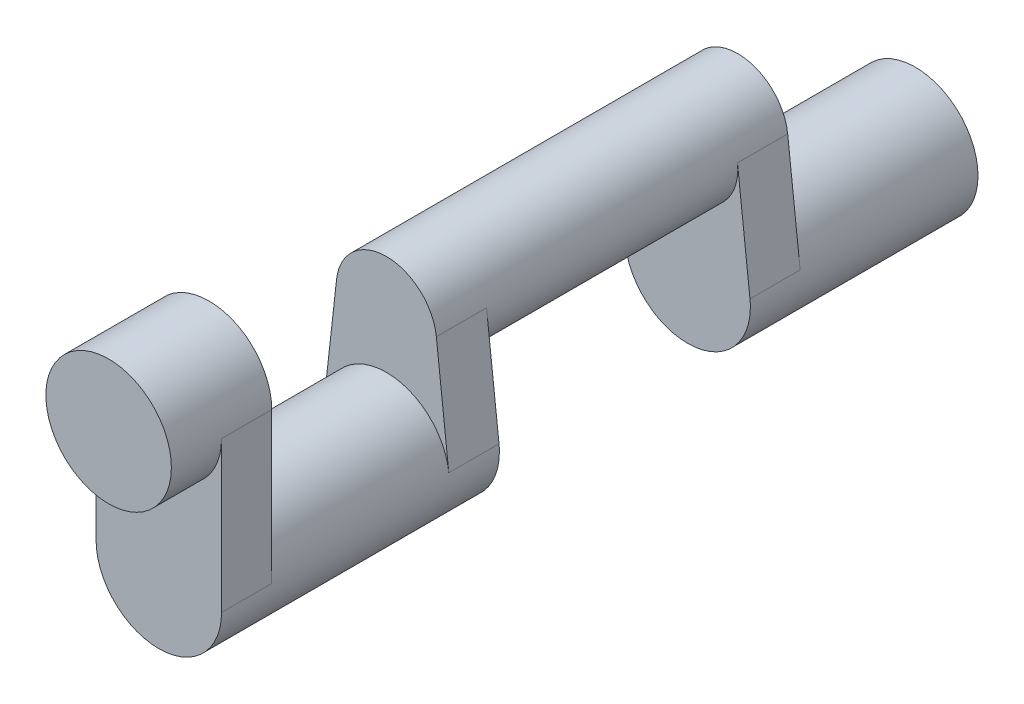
from build123d import *

# Parameters (mm, degrees)
EXTRUDE1_DEPTH      = 12.7
EXTRUDE1_DEPTH_BACK = 77.10193
SKETCH1_R           = 31.75
EXTRUDE2_DEPTH      = 25.4
SKETCH3_R           = 25.4
EXTRUDE3_DEPTH      = 63.5
EXTRUDE4_DEPTH      = 25.4
SKETCH5_R           = 31.75
EXTRUDE5_DEPTH      = 25.4


with BuildPart() as part:
    # Sketch1 → Extrude1 (new, two sides: drawn at the far end of the back side and taken through both)
    with BuildSketch(Plane.XY.offset(-EXTRUDE1_DEPTH_BACK)):
        Circle(SKETCH1_R)
    extrude(amount=EXTRUDE1_DEPTH + EXTRUDE1_DEPTH_BACK)

    # Sketch2 → Extrude2 (add)
    with BuildSketch(Plane(origin=(0, 0, -77.101929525), x_dir=(-1, 0, 0), z_dir=(0, 0, -1))):
        with BuildLine():
            Line((31.553403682, 3.527777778), (25.242722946, 59.972222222))
            ThreePointArc((25.242722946, 59.972222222), (0, 82.55), (-25.242722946, 59.972222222))
            Line((-25.242722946, 59.972222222), (-31.553403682, 3.527777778))
            ThreePointArc((-31.553403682, 3.527777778), (0, -31.75), (31.553403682, 3.527777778))
        make_face()
    extrude(amount=EXTRUDE2_DEPTH)

    # Sketch3 → Extrude3 (add)
    with BuildSketch(Plane(origin=(0, 0, -102.501929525), x_dir=(-1, 0, 0), z_dir=(0, 0, -1))):
        with Locations(Location((0, 57.15, 0), (0, 0, 173.620629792))):
            Circle(SKETCH3_R)
    extrude(amount=EXTRUDE3_DEPTH)

    # Mirror1: part across plane


with BuildPart() as part_1:
    add(part.part)
    add(part.part.mirror(Plane(origin=(0, 57.15, -166.001929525), x_dir=(1, 0, 0), z_dir=(0, 0, -1))))

    # Sketch4 → Extrude4 (add)
    with BuildSketch(Plane.XY.offset(12.7)):
        with BuildLine():
            Line((31.75, 0), (31.75, 76.2))
            ThreePointArc((31.75, 76.2), (0, 107.95), (-31.75, 76.2))
            Line((-31.75, 76.2), (-31.75, 0))
            ThreePointArc((-31.75, 0), (0, -31.75), (31.75, 0))
        make_face()
    extrude(amount=EXTRUDE4_DEPTH)

    # Sketch5 → Extrude5 (add)
    with BuildSketch(Plane.XY.offset(38.1)):
        with Locations((0, 76.2)):
            Circle(SKETCH5_R)
    extrude(amount=EXTRUDE5_DEPTH)


solid = part_1.part
